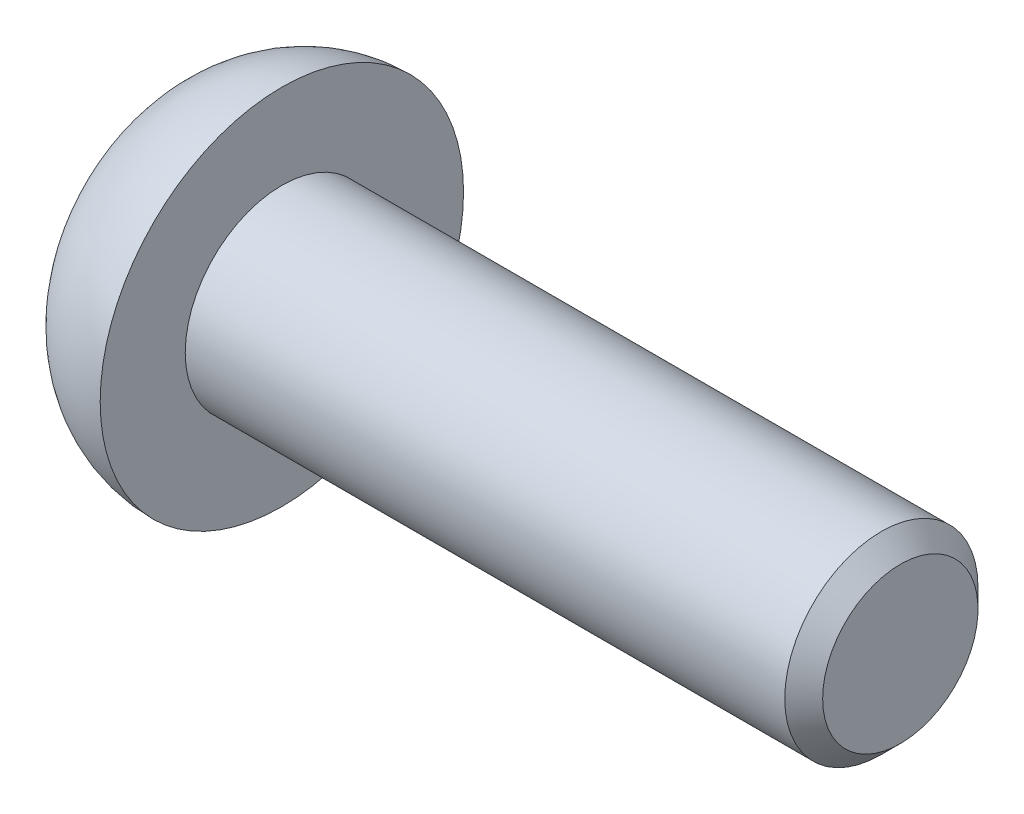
from build123d import *

# Parameters (mm, degrees)
ENL_V_MAT_EXTRU_1_DEPTH = 2.7


with BuildPart() as part:
    # Esquisse1 → R_volution1 (revolve)
    with BuildSketch(Plane.XY, mode=Mode.PRIVATE) as r_volution1_sk:
        with BuildLine():
            Line((-2.7, 0), (-2.7, 3.361859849))
            ThreePointArc((-2.7, 3.361859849), (-1.506703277, 4.347114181), (0, 4.7))
            Line((0, 4.7), (0, 2.5))
            Line((0, 2.5), (15.5095, 2.5))
            Line((15.5095, 2.5), (16, 2.0095))
            Line((16, 2.0095), (16, 0))
            Line((16, 0), (-2.7, 0))
        make_face()
    revolve(r_volution1_sk.sketch.rotate(Axis((16, 0, 0), (-1, 0, 0)), 270), axis=Axis((16, 0, 0), (-1, 0, 0)))

    # Esquisse2 → Enl_vement de mati_re-R_volution1 (revolve, cut)
    with BuildSketch(Plane.XY, mode=Mode.PRIVATE) as enl_vement_de_mati_re_r_volution1_sk:
        Polygon((-2.8, 0), (-2.8, 2.35), (-2.655, 2.35), (-2.025319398, 0), align=None)
    revolve(enl_vement_de_mati_re_r_volution1_sk.sketch.rotate(Axis((-2.025319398, 0, 0), (-1, 0, 0)), 180), axis=Axis((-2.025319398, 0, 0), (-1, 0, 0)), mode=Mode.SUBTRACT)

    # Esquisse3 → Enl_v. mat.-Extru.1 (cut)
    with BuildSketch(Plane(origin=(-1.35, 0, 0), x_dir=(0, 0, -1), z_dir=(1, 0, 0))):
        with BuildLine():
            ThreePointArc((-1.912303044, 0.439800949), (-2.26, 0), (-1.912303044, -0.439800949))
            ThreePointArc((-1.912303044, -0.439800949), (-1.409807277, -0.813952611), (-1.337030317, -1.436202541))
            ThreePointArc((-1.337030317, -1.436202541), (-1.13, -1.957217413), (-0.575272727, -1.87600349))
            ThreePointArc((-0.575272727, -1.87600349), (0, -1.627905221), (0.575272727, -1.87600349))
            ThreePointArc((0.575272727, -1.87600349), (1.129999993, -1.957217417), (1.337030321, -1.436202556))
            ThreePointArc((1.337030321, -1.436202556), (1.409807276, -0.813952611), (1.912303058, -0.439800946))
            ThreePointArc((1.912303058, -0.439800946), (2.26, 7e-09), (1.912303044, 0.439800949))
            ThreePointArc((1.912303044, 0.439800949), (1.409807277, 0.813952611), (1.337030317, 1.436202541))
            ThreePointArc((1.337030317, 1.436202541), (1.13, 1.957217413), (0.575272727, 1.87600349))
            ThreePointArc((0.575272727, 1.87600349), (0, 1.627905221), (-0.575272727, 1.87600349))
            ThreePointArc((-0.575272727, 1.87600349), (-1.13, 1.957217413), (-1.337030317, 1.436202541))
            ThreePointArc((-1.337030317, 1.436202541), (-1.409807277, 0.813952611), (-1.912303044, 0.439800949))
        make_face()
    extrude(amount=-ENL_V_MAT_EXTRU_1_DEPTH, mode=Mode.SUBTRACT)


solid = part.part
